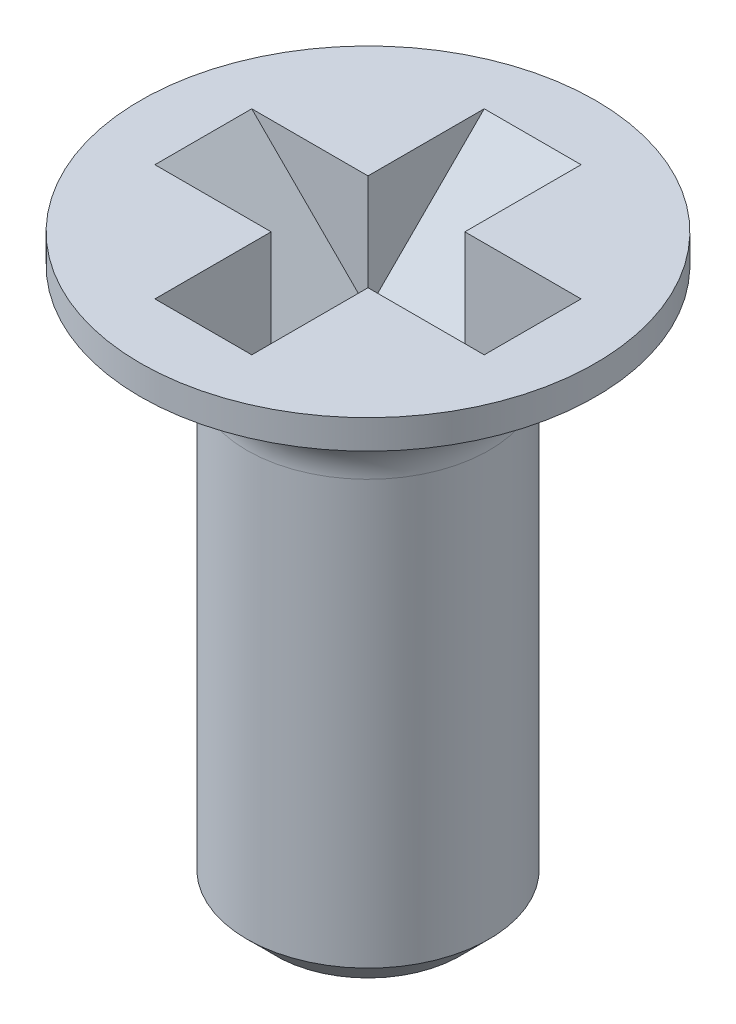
ISO-10303-21;
HEADER;
FILE_DESCRIPTION(('STEP AP214'),'2;1');
FILE_NAME('part.step','',(''),(''),'','','');
FILE_SCHEMA(('AUTOMOTIVE_DESIGN { 1 0 10303 214 1 1 1 1 }'));
ENDSEC;
DATA;
#1=APPLICATION_CONTEXT('core data for automotive mechanical design processes');
#2=APPLICATION_PROTOCOL_DEFINITION('international standard','automotive_design',2000,#1);
#3=PRODUCT_CONTEXT('',#1,'mechanical');
#4=PRODUCT('Part','Part','',(#3));
#5=PRODUCT_RELATED_PRODUCT_CATEGORY('part','',(#4));
#6=PRODUCT_DEFINITION_FORMATION('','',#4);
#7=PRODUCT_DEFINITION_CONTEXT('part definition',#1,'design');
#8=PRODUCT_DEFINITION('design','',#6,#7);
#9=PRODUCT_DEFINITION_SHAPE('','',#8);
#10=(LENGTH_UNIT() NAMED_UNIT(*) SI_UNIT(.MILLI.,.METRE.));
#11=(NAMED_UNIT(*) PLANE_ANGLE_UNIT() SI_UNIT($,.RADIAN.));
#12=(NAMED_UNIT(*) SI_UNIT($,.STERADIAN.) SOLID_ANGLE_UNIT());
#13=UNCERTAINTY_MEASURE_WITH_UNIT(LENGTH_MEASURE(1.E-05),#10,'distance_accuracy_value','');
#14=(GEOMETRIC_REPRESENTATION_CONTEXT(3) GLOBAL_UNCERTAINTY_ASSIGNED_CONTEXT((#13)) GLOBAL_UNIT_ASSIGNED_CONTEXT((#10,
#11,#12)) REPRESENTATION_CONTEXT('',''));
#15=CARTESIAN_POINT('',(0.,0.,0.));
#16=DIRECTION('',(0.,0.,1.));
#17=DIRECTION('',(1.,0.,0.));
#18=AXIS2_PLACEMENT_3D('',#15,#16,#17);
#19=CARTESIAN_POINT('',(0.,0.,0.));
#20=DIRECTION('',(0.,1.,0.));
#21=DIRECTION('',(0.,0.,1.));
#22=AXIS2_PLACEMENT_3D('',#19,#20,#21);
#23=PLANE('',#22);
#24=DIRECTION('',(0.,0.,1.));
#25=VECTOR('',#24,1.);
#26=CARTESIAN_POINT('',(-0.499999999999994,0.,1.69999999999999));
#27=LINE('',#26,#25);
#28=CARTESIAN_POINT('',(-0.499999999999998,0.,0.5));
#29=VERTEX_POINT('',#28);
#30=CARTESIAN_POINT('',(-0.499999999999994,0.,1.69999999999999));
#31=VERTEX_POINT('',#30);
#32=EDGE_CURVE('E144',#29,#31,#27,.T.);
#33=ORIENTED_EDGE('',*,*,#32,.F.);
#34=DIRECTION('',(-1.,0.,0.));
#35=VECTOR('',#34,1.);
#36=CARTESIAN_POINT('',(-1.69999999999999,0.,0.5));
#37=LINE('',#36,#35);
#38=CARTESIAN_POINT('',(-1.69999999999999,0.,0.5));
#39=VERTEX_POINT('',#38);
#40=EDGE_CURVE('E49',#29,#39,#37,.T.);
#41=ORIENTED_EDGE('',*,*,#40,.T.);
#42=DIRECTION('',(0.,0.,1.));
#43=VECTOR('',#42,1.);
#44=CARTESIAN_POINT('',(-1.69999999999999,0.,-0.5));
#45=LINE('',#44,#43);
#46=CARTESIAN_POINT('',(-1.69999999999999,0.,-0.5));
#47=VERTEX_POINT('',#46);
#48=EDGE_CURVE('E164',#47,#39,#45,.T.);
#49=ORIENTED_EDGE('',*,*,#48,.F.);
#50=DIRECTION('',(-1.,0.,0.));
#51=VECTOR('',#50,1.);
#52=CARTESIAN_POINT('',(-1.69999999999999,0.,-0.5));
#53=LINE('',#52,#51);
#54=CARTESIAN_POINT('',(-0.500000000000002,0.,-0.499999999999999));
#55=VERTEX_POINT('',#54);
#56=EDGE_CURVE('E58',#55,#47,#53,.T.);
#57=ORIENTED_EDGE('',*,*,#56,.F.);
#58=CARTESIAN_POINT('',(-0.500000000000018,0.,-1.69999999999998));
#59=VERTEX_POINT('',#58);
#60=EDGE_CURVE('E125',#59,#55,#27,.T.);
#61=ORIENTED_EDGE('',*,*,#60,.F.);
#62=DIRECTION('',(-1.,0.,0.));
#63=VECTOR('',#62,1.);
#64=CARTESIAN_POINT('',(0.499999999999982,0.,-1.69999999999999));
#65=LINE('',#64,#63);
#66=CARTESIAN_POINT('',(0.499999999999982,0.,-1.69999999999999));
#67=VERTEX_POINT('',#66);
#68=EDGE_CURVE('E117',#67,#59,#65,.T.);
#69=ORIENTED_EDGE('',*,*,#68,.F.);
#70=DIRECTION('',(0.,0.,-1.));
#71=VECTOR('',#70,1.);
#72=CARTESIAN_POINT('',(0.499999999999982,0.,-1.69999999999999));
#73=LINE('',#72,#71);
#74=CARTESIAN_POINT('',(0.499999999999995,0.,-0.5));
#75=VERTEX_POINT('',#74);
#76=EDGE_CURVE('E102',#75,#67,#73,.T.);
#77=ORIENTED_EDGE('',*,*,#76,.F.);
#78=DIRECTION('',(1.,0.,0.));
#79=VECTOR('',#78,1.);
#80=CARTESIAN_POINT('',(1.69999999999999,0.,-0.5));
#81=LINE('',#80,#79);
#82=CARTESIAN_POINT('',(1.69999999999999,0.,-0.5));
#83=VERTEX_POINT('',#82);
#84=EDGE_CURVE('E126',#75,#83,#81,.T.);
#85=ORIENTED_EDGE('',*,*,#84,.T.);
#86=DIRECTION('',(0.,0.,-1.));
#87=VECTOR('',#86,1.);
#88=CARTESIAN_POINT('',(1.69999999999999,0.,0.5));
#89=LINE('',#88,#87);
#90=CARTESIAN_POINT('',(1.69999999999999,0.,0.5));
#91=VERTEX_POINT('',#90);
#92=EDGE_CURVE('E136',#91,#83,#89,.T.);
#93=ORIENTED_EDGE('',*,*,#92,.F.);
#94=DIRECTION('',(1.,0.,0.));
#95=VECTOR('',#94,1.);
#96=CARTESIAN_POINT('',(1.69999999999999,0.,0.5));
#97=LINE('',#96,#95);
#98=CARTESIAN_POINT('',(0.500000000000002,0.,0.5));
#99=VERTEX_POINT('',#98);
#100=EDGE_CURVE('E132',#99,#91,#97,.T.);
#101=ORIENTED_EDGE('',*,*,#100,.F.);
#102=DIRECTION('',(0.,0.,1.));
#103=VECTOR('',#102,1.);
#104=CARTESIAN_POINT('',(0.500000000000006,0.,1.69999999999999));
#105=LINE('',#104,#103);
#106=CARTESIAN_POINT('',(0.500000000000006,0.,1.69999999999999));
#107=VERTEX_POINT('',#106);
#108=EDGE_CURVE('E141',#99,#107,#105,.T.);
#109=ORIENTED_EDGE('',*,*,#108,.T.);
#110=DIRECTION('',(1.,0.,0.));
#111=VECTOR('',#110,1.);
#112=CARTESIAN_POINT('',(-0.499999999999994,0.,1.69999999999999));
#113=LINE('',#112,#111);
#114=EDGE_CURVE('E146',#31,#107,#113,.T.);
#115=ORIENTED_EDGE('',*,*,#114,.F.);
#116=EDGE_LOOP('',(#33,#41,#49,#57,#61,#69,#77,#85,#93,#101,#109,#115));
#117=FACE_BOUND('',#116,.T.);
#118=CARTESIAN_POINT('',(0.,0.,0.));
#119=DIRECTION('',(0.,1.,0.));
#120=DIRECTION('',(0.,0.,1.));
#121=AXIS2_PLACEMENT_3D('',#118,#119,#120);
#122=CIRCLE('',#121,2.35);
#123=CARTESIAN_POINT('',(0.,0.,2.35));
#124=VERTEX_POINT('',#123);
#125=EDGE_CURVE('E184',#124,#124,#122,.T.);
#126=ORIENTED_EDGE('',*,*,#125,.T.);
#127=EDGE_LOOP('',(#126));
#128=FACE_BOUND('',#127,.T.);
#129=ADVANCED_FACE('F34',(#117,#128),#23,.T.);
#130=CARTESIAN_POINT('',(0.,8.01052109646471,0.));
#131=DIRECTION('',(0.,1.,0.));
#132=DIRECTION('',(0.,0.,1.));
#133=AXIS2_PLACEMENT_3D('',#130,#131,#132);
#134=CYLINDRICAL_SURFACE('',#133,2.35);
#135=CARTESIAN_POINT('',(0.,-0.3,0.));
#136=DIRECTION('',(0.,1.,0.));
#137=DIRECTION('',(0.,0.,1.));
#138=AXIS2_PLACEMENT_3D('',#135,#136,#137);
#139=CIRCLE('',#138,2.35);
#140=CARTESIAN_POINT('',(0.,-0.3,2.35));
#141=VERTEX_POINT('',#140);
#142=EDGE_CURVE('E181',#141,#141,#139,.T.);
#143=ORIENTED_EDGE('',*,*,#142,.T.);
#144=EDGE_LOOP('',(#143));
#145=FACE_BOUND('',#144,.T.);
#146=ORIENTED_EDGE('',*,*,#125,.F.);
#147=EDGE_LOOP('',(#146));
#148=FACE_BOUND('',#147,.T.);
#149=ADVANCED_FACE('F214',(#145,#148),#134,.T.);
#150=CARTESIAN_POINT('',(0.,-0.3,0.));
#151=DIRECTION('',(0.,1.,0.));
#152=DIRECTION('',(0.,0.,1.));
#153=AXIS2_PLACEMENT_3D('',#150,#151,#152);
#154=CONICAL_SURFACE('',#153,2.35,1.00406710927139);
#155=CARTESIAN_POINT('',(0.,-0.823170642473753,0.));
#156=DIRECTION('',(0.,1.,0.));
#157=DIRECTION('',(0.,0.,1.));
#158=AXIS2_PLACEMENT_3D('',#155,#156,#157);
#159=CIRCLE('',#158,1.5278747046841);
#160=CARTESIAN_POINT('',(0.,-0.823170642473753,1.5278747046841));
#161=VERTEX_POINT('',#160);
#162=EDGE_CURVE('E178',#161,#161,#159,.T.);
#163=ORIENTED_EDGE('',*,*,#162,.T.);
#164=EDGE_LOOP('',(#163));
#165=FACE_BOUND('',#164,.T.);
#166=ORIENTED_EDGE('',*,*,#142,.F.);
#167=EDGE_LOOP('',(#166));
#168=FACE_BOUND('',#167,.T.);
#169=ADVANCED_FACE('F208',(#165,#168),#154,.T.);
#170=CARTESIAN_POINT('',(0.,-1.32936753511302,0.));
#171=DIRECTION('',(0.,1.,0.));
#172=DIRECTION('',(0.,0.,1.));
#173=AXIS2_PLACEMENT_3D('',#170,#171,#172);
#174=TOROIDAL_SURFACE('',#173,1.85,0.6);
#175=CARTESIAN_POINT('',(0.,-1.32936753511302,0.));
#176=DIRECTION('',(0.,1.,0.));
#177=DIRECTION('',(0.,0.,1.));
#178=AXIS2_PLACEMENT_3D('',#175,#176,#177);
#179=CIRCLE('',#178,1.25);
#180=CARTESIAN_POINT('',(0.,-1.32936753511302,1.25));
#181=VERTEX_POINT('',#180);
#182=EDGE_CURVE('E173',#181,#181,#179,.T.);
#183=ORIENTED_EDGE('',*,*,#182,.T.);
#184=EDGE_LOOP('',(#183));
#185=FACE_BOUND('',#184,.T.);
#186=ORIENTED_EDGE('',*,*,#162,.F.);
#187=EDGE_LOOP('',(#186));
#188=FACE_BOUND('',#187,.T.);
#189=ADVANCED_FACE('F202',(#185,#188),#174,.F.);
#190=CARTESIAN_POINT('',(0.,8.01052109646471,0.));
#191=DIRECTION('',(0.,1.,0.));
#192=DIRECTION('',(0.,0.,1.));
#193=AXIS2_PLACEMENT_3D('',#190,#191,#192);
#194=CYLINDRICAL_SURFACE('',#193,1.25);
#195=CARTESIAN_POINT('',(0.,-5.7,0.));
#196=DIRECTION('',(0.,-1.,0.));
#197=DIRECTION('',(0.,0.,-1.));
#198=AXIS2_PLACEMENT_3D('',#195,#196,#197);
#199=CIRCLE('',#198,1.25);
#200=CARTESIAN_POINT('',(0.,-5.7,-1.25));
#201=VERTEX_POINT('',#200);
#202=EDGE_CURVE('E187',#201,#201,#199,.F.);
#203=ORIENTED_EDGE('',*,*,#202,.T.);
#204=EDGE_LOOP('',(#203));
#205=FACE_BOUND('',#204,.T.);
#206=ORIENTED_EDGE('',*,*,#182,.F.);
#207=EDGE_LOOP('',(#206));
#208=FACE_BOUND('',#207,.T.);
#209=ADVANCED_FACE('F199',(#205,#208),#194,.T.);
#210=CARTESIAN_POINT('',(-1.25,-6.,0.));
#211=DIRECTION('',(0.,-1.,0.));
#212=DIRECTION('',(0.,0.,-1.));
#213=AXIS2_PLACEMENT_3D('',#210,#211,#212);
#214=PLANE('',#213);
#215=CARTESIAN_POINT('',(0.,-6.,0.));
#216=DIRECTION('',(0.,-1.,0.));
#217=DIRECTION('',(0.,0.,-1.));
#218=AXIS2_PLACEMENT_3D('',#215,#216,#217);
#219=CIRCLE('',#218,0.949999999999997);
#220=CARTESIAN_POINT('',(0.,-6.,-0.949999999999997));
#221=VERTEX_POINT('',#220);
#222=EDGE_CURVE('E42',#221,#221,#219,.T.);
#223=ORIENTED_EDGE('',*,*,#222,.T.);
#224=EDGE_LOOP('',(#223));
#225=FACE_BOUND('',#224,.T.);
#226=ADVANCED_FACE('F192',(#225),#214,.T.);
#227=CARTESIAN_POINT('',(0.,-5.7,0.));
#228=DIRECTION('',(0.,1.,0.));
#229=DIRECTION('',(0.,0.,1.));
#230=AXIS2_PLACEMENT_3D('',#227,#228,#229);
#231=CONICAL_SURFACE('',#230,1.25,0.785398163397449);
#232=ORIENTED_EDGE('',*,*,#222,.F.);
#233=EDGE_LOOP('',(#232));
#234=FACE_BOUND('',#233,.T.);
#235=ORIENTED_EDGE('',*,*,#202,.F.);
#236=EDGE_LOOP('',(#235));
#237=FACE_BOUND('',#236,.T.);
#238=ADVANCED_FACE('F36',(#234,#237),#231,.T.);
#239=CARTESIAN_POINT('',(-0.5,-1.2,-0.5));
#240=DIRECTION('',(0.,-1.,0.));
#241=DIRECTION('',(0.,0.,-1.));
#242=AXIS2_PLACEMENT_3D('',#239,#240,#241);
#243=PLANE('',#242);
#244=DIRECTION('',(1.,0.,0.));
#245=VECTOR('',#244,1.);
#246=CARTESIAN_POINT('',(-0.5,-1.2,0.5));
#247=LINE('',#246,#245);
#248=CARTESIAN_POINT('',(-0.5,-1.2,0.5));
#249=VERTEX_POINT('',#248);
#250=CARTESIAN_POINT('',(0.5,-1.2,0.5));
#251=VERTEX_POINT('',#250);
#252=EDGE_CURVE('E161',#249,#251,#247,.T.);
#253=ORIENTED_EDGE('',*,*,#252,.T.);
#254=DIRECTION('',(0.,0.,-1.));
#255=VECTOR('',#254,1.);
#256=CARTESIAN_POINT('',(0.500000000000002,-1.2,0.499999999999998));
#257=LINE('',#256,#255);
#258=CARTESIAN_POINT('',(0.499999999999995,-1.2,-0.500000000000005));
#259=VERTEX_POINT('',#258);
#260=EDGE_CURVE('E152',#251,#259,#257,.T.);
#261=ORIENTED_EDGE('',*,*,#260,.T.);
#262=DIRECTION('',(1.,0.,0.));
#263=VECTOR('',#262,1.);
#264=CARTESIAN_POINT('',(-0.5,-1.2,-0.5));
#265=LINE('',#264,#263);
#266=CARTESIAN_POINT('',(-0.500000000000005,-1.2,-0.499999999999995));
#267=VERTEX_POINT('',#266);
#268=EDGE_CURVE('E120',#267,#259,#265,.T.);
#269=ORIENTED_EDGE('',*,*,#268,.F.);
#270=DIRECTION('',(0.,0.,1.));
#271=VECTOR('',#270,1.);
#272=CARTESIAN_POINT('',(-0.5,-1.2,-0.5));
#273=LINE('',#272,#271);
#274=EDGE_CURVE('E170',#267,#249,#273,.T.);
#275=ORIENTED_EDGE('',*,*,#274,.T.);
#276=EDGE_LOOP('',(#253,#261,#269,#275));
#277=FACE_BOUND('',#276,.T.);
#278=ADVANCED_FACE('F196',(#277),#243,.F.);
#279=CARTESIAN_POINT('',(-0.5,-1.2,-0.5));
#280=DIRECTION('',(-0.707106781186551,-0.707106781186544,0.));
#281=DIRECTION('',(0.707106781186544,-0.707106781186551,0.));
#282=AXIS2_PLACEMENT_3D('',#279,#280,#281);
#283=PLANE('',#282);
#284=DIRECTION('',(0.707106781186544,-0.707106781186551,0.));
#285=VECTOR('',#284,1.);
#286=CARTESIAN_POINT('',(-0.5,-1.2,0.5));
#287=LINE('',#286,#285);
#288=EDGE_CURVE('E166',#39,#249,#287,.T.);
#289=ORIENTED_EDGE('',*,*,#288,.T.);
#290=ORIENTED_EDGE('',*,*,#274,.F.);
#291=DIRECTION('',(0.707106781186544,-0.707106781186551,0.));
#292=VECTOR('',#291,1.);
#293=CARTESIAN_POINT('',(-0.5,-1.2,-0.5));
#294=LINE('',#293,#292);
#295=EDGE_CURVE('E160',#47,#267,#294,.T.);
#296=ORIENTED_EDGE('',*,*,#295,.F.);
#297=ORIENTED_EDGE('',*,*,#48,.T.);
#298=EDGE_LOOP('',(#289,#290,#296,#297));
#299=FACE_BOUND('',#298,.T.);
#300=ADVANCED_FACE('F228',(#299),#283,.F.);
#301=CARTESIAN_POINT('',(0.,0.,-0.5));
#302=DIRECTION('',(0.,0.,-1.));
#303=DIRECTION('',(-1.,0.,0.));
#304=AXIS2_PLACEMENT_3D('',#301,#302,#303);
#305=PLANE('',#304);
#306=ORIENTED_EDGE('',*,*,#295,.T.);
#307=DIRECTION('',(0.,1.,0.));
#308=VECTOR('',#307,1.);
#309=CARTESIAN_POINT('',(-0.500000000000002,0.,-0.5));
#310=LINE('',#309,#308);
#311=EDGE_CURVE('E157',#267,#55,#310,.T.);
#312=ORIENTED_EDGE('',*,*,#311,.T.);
#313=ORIENTED_EDGE('',*,*,#56,.T.);
#314=EDGE_LOOP('',(#306,#312,#313));
#315=FACE_BOUND('',#314,.T.);
#316=ADVANCED_FACE('F231',(#315),#305,.F.);
#317=CARTESIAN_POINT('',(0.,0.,0.5));
#318=DIRECTION('',(0.,0.,-1.));
#319=DIRECTION('',(-1.,0.,0.));
#320=AXIS2_PLACEMENT_3D('',#317,#318,#319);
#321=PLANE('',#320);
#322=DIRECTION('',(0.,1.,0.));
#323=VECTOR('',#322,1.);
#324=CARTESIAN_POINT('',(-0.499999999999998,0.,0.5));
#325=LINE('',#324,#323);
#326=EDGE_CURVE('E11',#249,#29,#325,.T.);
#327=ORIENTED_EDGE('',*,*,#326,.F.);
#328=ORIENTED_EDGE('',*,*,#288,.F.);
#329=ORIENTED_EDGE('',*,*,#40,.F.);
#330=EDGE_LOOP('',(#327,#328,#329));
#331=FACE_BOUND('',#330,.T.);
#332=ADVANCED_FACE('F236',(#331),#321,.T.);
#333=CARTESIAN_POINT('',(-0.5,0.,0.));
#334=DIRECTION('',(-1.,0.,0.));
#335=DIRECTION('',(0.,0.,1.));
#336=AXIS2_PLACEMENT_3D('',#333,#334,#335);
#337=PLANE('',#336);
#338=DIRECTION('',(0.,-0.707106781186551,0.707106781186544));
#339=VECTOR('',#338,1.);
#340=CARTESIAN_POINT('',(-0.500000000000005,-1.2,-0.499999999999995));
#341=LINE('',#340,#339);
#342=EDGE_CURVE('E112',#59,#267,#341,.T.);
#343=ORIENTED_EDGE('',*,*,#342,.F.);
#344=ORIENTED_EDGE('',*,*,#60,.T.);
#345=ORIENTED_EDGE('',*,*,#311,.F.);
#346=EDGE_LOOP('',(#343,#344,#345));
#347=FACE_BOUND('',#346,.T.);
#348=ADVANCED_FACE('F239',(#347),#337,.F.);
#349=CARTESIAN_POINT('',(-0.499999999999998,-1.2,0.500000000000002));
#350=DIRECTION('',(0.,-0.707106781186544,0.707106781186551));
#351=DIRECTION('',(0.,-0.707106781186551,-0.707106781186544));
#352=AXIS2_PLACEMENT_3D('',#349,#350,#351);
#353=PLANE('',#352);
#354=DIRECTION('',(0.,-0.707106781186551,-0.707106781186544));
#355=VECTOR('',#354,1.);
#356=CARTESIAN_POINT('',(0.500000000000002,-1.2,0.499999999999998));
#357=LINE('',#356,#355);
#358=EDGE_CURVE('E149',#107,#251,#357,.T.);
#359=ORIENTED_EDGE('',*,*,#358,.T.);
#360=ORIENTED_EDGE('',*,*,#252,.F.);
#361=DIRECTION('',(0.,-0.707106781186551,-0.707106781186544));
#362=VECTOR('',#361,1.);
#363=CARTESIAN_POINT('',(-0.499999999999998,-1.2,0.500000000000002));
#364=LINE('',#363,#362);
#365=EDGE_CURVE('E143',#31,#249,#364,.T.);
#366=ORIENTED_EDGE('',*,*,#365,.F.);
#367=ORIENTED_EDGE('',*,*,#114,.T.);
#368=EDGE_LOOP('',(#359,#360,#366,#367));
#369=FACE_BOUND('',#368,.T.);
#370=ADVANCED_FACE('F243',(#369),#353,.F.);
#371=ORIENTED_EDGE('',*,*,#326,.T.);
#372=ORIENTED_EDGE('',*,*,#32,.T.);
#373=ORIENTED_EDGE('',*,*,#365,.T.);
#374=EDGE_LOOP('',(#371,#372,#373));
#375=FACE_BOUND('',#374,.T.);
#376=ADVANCED_FACE('F246',(#375),#337,.F.);
#377=CARTESIAN_POINT('',(0.5,0.,0.));
#378=DIRECTION('',(-1.,0.,0.));
#379=DIRECTION('',(0.,0.,1.));
#380=AXIS2_PLACEMENT_3D('',#377,#378,#379);
#381=PLANE('',#380);
#382=ORIENTED_EDGE('',*,*,#358,.F.);
#383=ORIENTED_EDGE('',*,*,#108,.F.);
#384=DIRECTION('',(0.,1.,0.));
#385=VECTOR('',#384,1.);
#386=CARTESIAN_POINT('',(0.500000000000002,0.,0.5));
#387=LINE('',#386,#385);
#388=EDGE_CURVE('E155',#251,#99,#387,.T.);
#389=ORIENTED_EDGE('',*,*,#388,.F.);
#390=EDGE_LOOP('',(#382,#383,#389));
#391=FACE_BOUND('',#390,.T.);
#392=ADVANCED_FACE('F248',(#391),#381,.T.);
#393=CARTESIAN_POINT('',(0.,0.,0.5));
#394=DIRECTION('',(0.,0.,1.));
#395=DIRECTION('',(1.,0.,0.));
#396=AXIS2_PLACEMENT_3D('',#393,#394,#395);
#397=PLANE('',#396);
#398=ORIENTED_EDGE('',*,*,#388,.T.);
#399=ORIENTED_EDGE('',*,*,#100,.T.);
#400=DIRECTION('',(-0.707106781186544,-0.707106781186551,0.));
#401=VECTOR('',#400,1.);
#402=CARTESIAN_POINT('',(0.5,-1.2,0.5));
#403=LINE('',#402,#401);
#404=EDGE_CURVE('E134',#91,#251,#403,.T.);
#405=ORIENTED_EDGE('',*,*,#404,.T.);
#406=EDGE_LOOP('',(#398,#399,#405));
#407=FACE_BOUND('',#406,.T.);
#408=ADVANCED_FACE('F251',(#407),#397,.F.);
#409=CARTESIAN_POINT('',(0.5,-1.2,0.5));
#410=DIRECTION('',(0.707106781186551,-0.707106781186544,0.));
#411=DIRECTION('',(0.707106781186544,0.707106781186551,0.));
#412=AXIS2_PLACEMENT_3D('',#409,#410,#411);
#413=PLANE('',#412);
#414=DIRECTION('',(-0.707106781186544,-0.707106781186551,0.));
#415=VECTOR('',#414,1.);
#416=CARTESIAN_POINT('',(0.5,-1.2,-0.5));
#417=LINE('',#416,#415);
#418=EDGE_CURVE('E128',#83,#259,#417,.T.);
#419=ORIENTED_EDGE('',*,*,#418,.T.);
#420=ORIENTED_EDGE('',*,*,#260,.F.);
#421=ORIENTED_EDGE('',*,*,#404,.F.);
#422=ORIENTED_EDGE('',*,*,#92,.T.);
#423=EDGE_LOOP('',(#419,#420,#421,#422));
#424=FACE_BOUND('',#423,.T.);
#425=ADVANCED_FACE('F256',(#424),#413,.F.);
#426=CARTESIAN_POINT('',(0.,0.,-0.5));
#427=DIRECTION('',(0.,0.,1.));
#428=DIRECTION('',(1.,0.,0.));
#429=AXIS2_PLACEMENT_3D('',#426,#427,#428);
#430=PLANE('',#429);
#431=ORIENTED_EDGE('',*,*,#418,.F.);
#432=ORIENTED_EDGE('',*,*,#84,.F.);
#433=DIRECTION('',(0.,1.,0.));
#434=VECTOR('',#433,1.);
#435=CARTESIAN_POINT('',(0.499999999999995,0.,-0.5));
#436=LINE('',#435,#434);
#437=EDGE_CURVE('E108',#259,#75,#436,.T.);
#438=ORIENTED_EDGE('',*,*,#437,.F.);
#439=EDGE_LOOP('',(#431,#432,#438));
#440=FACE_BOUND('',#439,.T.);
#441=ADVANCED_FACE('F259',(#440),#430,.T.);
#442=CARTESIAN_POINT('',(0.5,0.,0.));
#443=DIRECTION('',(1.,0.,0.));
#444=DIRECTION('',(0.,0.,-1.));
#445=AXIS2_PLACEMENT_3D('',#442,#443,#444);
#446=PLANE('',#445);
#447=ORIENTED_EDGE('',*,*,#437,.T.);
#448=ORIENTED_EDGE('',*,*,#76,.T.);
#449=DIRECTION('',(0.,-0.707106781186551,0.707106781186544));
#450=VECTOR('',#449,1.);
#451=CARTESIAN_POINT('',(0.499999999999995,-1.2,-0.500000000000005));
#452=LINE('',#451,#450);
#453=EDGE_CURVE('E105',#67,#259,#452,.T.);
#454=ORIENTED_EDGE('',*,*,#453,.T.);
#455=EDGE_LOOP('',(#447,#448,#454));
#456=FACE_BOUND('',#455,.T.);
#457=ADVANCED_FACE('F104',(#456),#446,.F.);
#458=CARTESIAN_POINT('',(0.499999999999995,-1.2,-0.500000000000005));
#459=DIRECTION('',(0.,-0.707106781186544,-0.707106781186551));
#460=DIRECTION('',(0.,0.707106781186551,-0.707106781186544));
#461=AXIS2_PLACEMENT_3D('',#458,#459,#460);
#462=PLANE('',#461);
#463=ORIENTED_EDGE('',*,*,#342,.T.);
#464=ORIENTED_EDGE('',*,*,#268,.T.);
#465=ORIENTED_EDGE('',*,*,#453,.F.);
#466=ORIENTED_EDGE('',*,*,#68,.T.);
#467=EDGE_LOOP('',(#463,#464,#465,#466));
#468=FACE_BOUND('',#467,.T.);
#469=ADVANCED_FACE('F116',(#468),#462,.F.);
#470=CLOSED_SHELL('',(#129,#149,#169,#189,#209,#226,#238,#278,#300,#316,#332,#348,#370,#376,
#392,#408,#425,#441,#457,#469));
#471=MANIFOLD_SOLID_BREP('B2',#470);
#472=ADVANCED_BREP_SHAPE_REPRESENTATION('',(#18,#471),#14);
#473=SHAPE_DEFINITION_REPRESENTATION(#9,#472);
ENDSEC;
END-ISO-10303-21;
